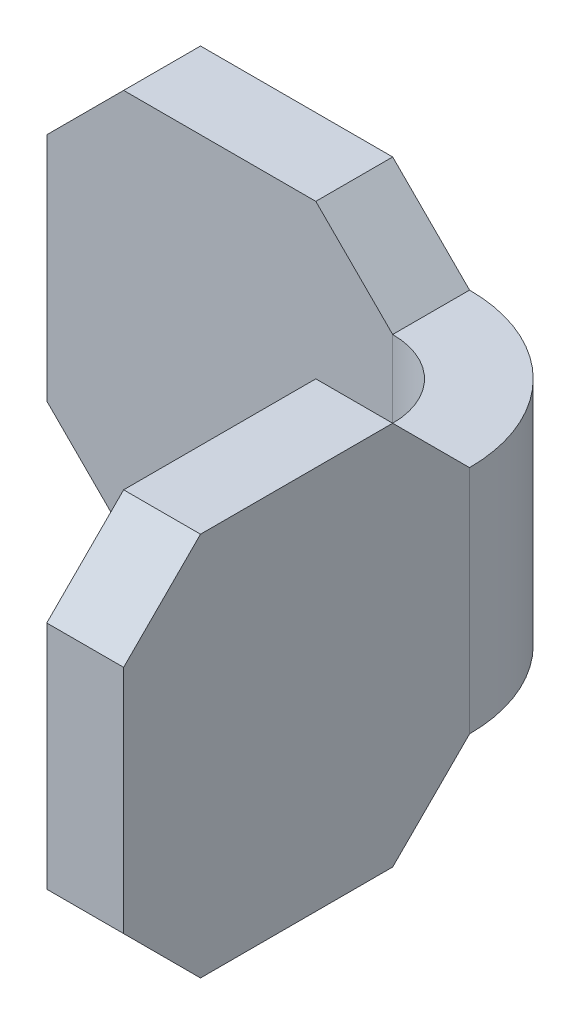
ISO-10303-21;
HEADER;
FILE_DESCRIPTION(('STEP AP214'),'2;1');
FILE_NAME('part.step','',(''),(''),'','','');
FILE_SCHEMA(('AUTOMOTIVE_DESIGN { 1 0 10303 214 1 1 1 1 }'));
ENDSEC;
DATA;
#1=APPLICATION_CONTEXT('core data for automotive mechanical design processes');
#2=APPLICATION_PROTOCOL_DEFINITION('international standard','automotive_design',2000,#1);
#3=PRODUCT_CONTEXT('',#1,'mechanical');
#4=PRODUCT('Part','Part','',(#3));
#5=PRODUCT_RELATED_PRODUCT_CATEGORY('part','',(#4));
#6=PRODUCT_DEFINITION_FORMATION('','',#4);
#7=PRODUCT_DEFINITION_CONTEXT('part definition',#1,'design');
#8=PRODUCT_DEFINITION('design','',#6,#7);
#9=PRODUCT_DEFINITION_SHAPE('','',#8);
#10=(LENGTH_UNIT() NAMED_UNIT(*) SI_UNIT(.MILLI.,.METRE.));
#11=(NAMED_UNIT(*) PLANE_ANGLE_UNIT() SI_UNIT($,.RADIAN.));
#12=(NAMED_UNIT(*) SI_UNIT($,.STERADIAN.) SOLID_ANGLE_UNIT());
#13=UNCERTAINTY_MEASURE_WITH_UNIT(LENGTH_MEASURE(1.E-05),#10,'distance_accuracy_value','');
#14=(GEOMETRIC_REPRESENTATION_CONTEXT(3) GLOBAL_UNCERTAINTY_ASSIGNED_CONTEXT((#13)) GLOBAL_UNIT_ASSIGNED_CONTEXT((#10,
#11,#12)) REPRESENTATION_CONTEXT('',''));
#15=CARTESIAN_POINT('',(0.,0.,0.));
#16=DIRECTION('',(0.,0.,1.));
#17=DIRECTION('',(1.,0.,0.));
#18=AXIS2_PLACEMENT_3D('',#15,#16,#17);
#19=CARTESIAN_POINT('',(1.49999999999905,5.5,0.0499999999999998));
#20=DIRECTION('',(1.,1.720846E-13,0.));
#21=DIRECTION('',(-1.720846E-13,1.,0.));
#22=AXIS2_PLACEMENT_3D('',#19,#20,#21);
#23=PLANE('',#22);
#24=DIRECTION('',(0.,-0.707106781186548,0.707106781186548));
#25=VECTOR('',#24,1.);
#26=CARTESIAN_POINT('',(1.50000000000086,-2.90000000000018,0.400000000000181));
#27=LINE('',#26,#25);
#28=CARTESIAN_POINT('',(1.50000000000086,-5.00000000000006,2.50000000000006));
#29=VERTEX_POINT('',#28);
#30=CARTESIAN_POINT('',(1.50000000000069,-3.,0.500000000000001));
#31=VERTEX_POINT('',#30);
#32=EDGE_CURVE('E57',#29,#31,#27,.F.);
#33=ORIENTED_EDGE('',*,*,#32,.T.);
#34=DIRECTION('',(-1.720846E-13,1.,0.));
#35=VECTOR('',#34,1.);
#36=CARTESIAN_POINT('',(1.49999999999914,5.,0.500000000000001));
#37=LINE('',#36,#35);
#38=CARTESIAN_POINT('',(1.49999999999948,3.,0.500000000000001));
#39=VERTEX_POINT('',#38);
#40=EDGE_CURVE('E206',#39,#31,#37,.F.);
#41=ORIENTED_EDGE('',*,*,#40,.F.);
#42=DIRECTION('',(0.,-0.707106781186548,-0.707106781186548));
#43=VECTOR('',#42,1.);
#44=CARTESIAN_POINT('',(1.49999999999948,5.09999999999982,2.59999999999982));
#45=LINE('',#44,#43);
#46=CARTESIAN_POINT('',(1.49999999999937,5.,2.5));
#47=VERTEX_POINT('',#46);
#48=EDGE_CURVE('E201',#39,#47,#45,.F.);
#49=ORIENTED_EDGE('',*,*,#48,.T.);
#50=DIRECTION('',(0.,0.,1.));
#51=VECTOR('',#50,1.);
#52=CARTESIAN_POINT('',(1.49999999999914,5.,2.25));
#53=LINE('',#52,#51);
#54=CARTESIAN_POINT('',(1.49999999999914,5.,7.5));
#55=VERTEX_POINT('',#54);
#56=EDGE_CURVE('E66',#47,#55,#53,.T.);
#57=ORIENTED_EDGE('',*,*,#56,.T.);
#58=DIRECTION('',(0.,0.707106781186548,-0.707106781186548));
#59=VECTOR('',#58,1.);
#60=CARTESIAN_POINT('',(1.49999999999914,5.10000000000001,7.39999999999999));
#61=LINE('',#60,#59);
#62=CARTESIAN_POINT('',(1.4999999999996,3.,9.5));
#63=VERTEX_POINT('',#62);
#64=EDGE_CURVE('E149',#55,#63,#61,.F.);
#65=ORIENTED_EDGE('',*,*,#64,.T.);
#66=DIRECTION('',(0.,1.,0.));
#67=VECTOR('',#66,1.);
#68=CARTESIAN_POINT('',(1.50000000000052,3.30000000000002,9.5));
#69=LINE('',#68,#67);
#70=CARTESIAN_POINT('',(1.50000000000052,-3.00000000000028,9.49999999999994));
#71=VERTEX_POINT('',#70);
#72=EDGE_CURVE('E179',#71,#63,#69,.T.);
#73=ORIENTED_EDGE('',*,*,#72,.F.);
#74=DIRECTION('',(0.,0.707106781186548,0.707106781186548));
#75=VECTOR('',#74,1.);
#76=CARTESIAN_POINT('',(1.50000000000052,-2.89999999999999,9.60000000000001));
#77=LINE('',#76,#75);
#78=CARTESIAN_POINT('',(1.50000000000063,-5.,7.5));
#79=VERTEX_POINT('',#78);
#80=EDGE_CURVE('E180',#71,#79,#77,.F.);
#81=ORIENTED_EDGE('',*,*,#80,.T.);
#82=DIRECTION('',(0.,0.,1.));
#83=VECTOR('',#82,1.);
#84=CARTESIAN_POINT('',(1.50000000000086,-5.,2.25));
#85=LINE('',#84,#83);
#86=EDGE_CURVE('E189',#29,#79,#85,.T.);
#87=ORIENTED_EDGE('',*,*,#86,.F.);
#88=EDGE_LOOP('',(#33,#41,#49,#57,#65,#73,#81,#87));
#89=FACE_BOUND('',#88,.T.);
#90=ADVANCED_FACE('F16',(#89),#23,.T.);
#91=CARTESIAN_POINT('',(-2.50000000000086,4.99999999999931,0.5));
#92=DIRECTION('',(-1.720846E-13,1.,0.));
#93=DIRECTION('',(-1.,-1.720846E-13,0.));
#94=AXIS2_PLACEMENT_3D('',#91,#92,#93);
#95=CYLINDRICAL_SURFACE('',#94,4.);
#96=ORIENTED_EDGE('',*,*,#40,.T.);
#97=CARTESIAN_POINT('',(-2.49999999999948,-3.00000000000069,0.5));
#98=DIRECTION('',(-1.720846E-13,1.,0.));
#99=DIRECTION('',(-1.,-1.720846E-13,0.));
#100=AXIS2_PLACEMENT_3D('',#97,#98,#99);
#101=CIRCLE('',#100,4.);
#102=CARTESIAN_POINT('',(-2.5,-3.00000000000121,-3.5));
#103=VERTEX_POINT('',#102);
#104=EDGE_CURVE('E19',#31,#103,#101,.T.);
#105=ORIENTED_EDGE('',*,*,#104,.T.);
#106=DIRECTION('',(0.,1.,0.));
#107=VECTOR('',#106,1.);
#108=CARTESIAN_POINT('',(-2.50000000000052,5.49999999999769,-3.5));
#109=LINE('',#108,#107);
#110=CARTESIAN_POINT('',(-2.50000000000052,2.99999999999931,-3.5));
#111=VERTEX_POINT('',#110);
#112=EDGE_CURVE('E203',#111,#103,#109,.F.);
#113=ORIENTED_EDGE('',*,*,#112,.F.);
#114=CARTESIAN_POINT('',(-2.50000000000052,2.99999999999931,0.5));
#115=DIRECTION('',(-1.720846E-13,1.,0.));
#116=DIRECTION('',(-1.,-1.720846E-13,0.));
#117=AXIS2_PLACEMENT_3D('',#114,#115,#116);
#118=CIRCLE('',#117,4.);
#119=EDGE_CURVE('E233',#111,#39,#118,.F.);
#120=ORIENTED_EDGE('',*,*,#119,.T.);
#121=EDGE_LOOP('',(#96,#105,#113,#120));
#122=FACE_BOUND('',#121,.T.);
#123=ADVANCED_FACE('F347',(#122),#95,.T.);
#124=CARTESIAN_POINT('',(-0.599999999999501,-2.90000000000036,0.4));
#125=DIRECTION('',(-1.21638891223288E-13,0.707106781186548,0.707106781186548));
#126=DIRECTION('',(0.,-0.707106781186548,0.707106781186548));
#127=AXIS2_PLACEMENT_3D('',#124,#125,#126);
#128=PLANE('',#127);
#129=DIRECTION('',(-1.,-1.720846E-13,0.));
#130=VECTOR('',#129,1.);
#131=CARTESIAN_POINT('',(1.70000000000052,-2.99999999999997,0.5));
#132=LINE('',#131,#130);
#133=CARTESIAN_POINT('',(-0.499999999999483,-3.00000000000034,0.5));
#134=VERTEX_POINT('',#133);
#135=EDGE_CURVE('E238',#134,#31,#132,.F.);
#136=ORIENTED_EDGE('',*,*,#135,.T.);
#137=ORIENTED_EDGE('',*,*,#32,.F.);
#138=DIRECTION('',(1.,1.720846E-13,0.));
#139=VECTOR('',#138,1.);
#140=CARTESIAN_POINT('',(-0.599999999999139,-5.00000000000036,2.5));
#141=LINE('',#140,#139);
#142=CARTESIAN_POINT('',(-0.499999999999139,-5.00000000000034,2.5));
#143=VERTEX_POINT('',#142);
#144=EDGE_CURVE('E196',#143,#29,#141,.T.);
#145=ORIENTED_EDGE('',*,*,#144,.F.);
#146=DIRECTION('',(1.2174349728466E-13,-0.707106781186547,0.707106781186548));
#147=VECTOR('',#146,1.);
#148=CARTESIAN_POINT('',(-0.499999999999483,-3.00000000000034,0.5));
#149=LINE('',#148,#147);
#150=EDGE_CURVE('E110',#134,#143,#149,.T.);
#151=ORIENTED_EDGE('',*,*,#150,.F.);
#152=EDGE_LOOP('',(#136,#137,#145,#151));
#153=FACE_BOUND('',#152,.T.);
#154=ADVANCED_FACE('F515',(#153),#128,.F.);
#155=CARTESIAN_POINT('',(-0.599999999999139,-5.00000000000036,2.25));
#156=DIRECTION('',(1.720846E-13,-1.,0.));
#157=DIRECTION('',(1.,1.720846E-13,0.));
#158=AXIS2_PLACEMENT_3D('',#155,#156,#157);
#159=PLANE('',#158);
#160=ORIENTED_EDGE('',*,*,#144,.T.);
#161=ORIENTED_EDGE('',*,*,#86,.T.);
#162=DIRECTION('',(1.,0.,0.));
#163=VECTOR('',#162,1.);
#164=CARTESIAN_POINT('',(1.6000000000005,-4.99999999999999,7.49999999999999));
#165=LINE('',#164,#163);
#166=CARTESIAN_POINT('',(-0.499999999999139,-5.00000000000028,7.50000000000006));
#167=VERTEX_POINT('',#166);
#168=EDGE_CURVE('E187',#79,#167,#165,.F.);
#169=ORIENTED_EDGE('',*,*,#168,.T.);
#170=DIRECTION('',(0.,0.,1.));
#171=VECTOR('',#170,1.);
#172=CARTESIAN_POINT('',(-0.499999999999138,-5.00000000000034,9.95));
#173=LINE('',#172,#171);
#174=EDGE_CURVE('E184',#143,#167,#173,.T.);
#175=ORIENTED_EDGE('',*,*,#174,.F.);
#176=EDGE_LOOP('',(#160,#161,#169,#175));
#177=FACE_BOUND('',#176,.T.);
#178=ADVANCED_FACE('F505',(#177),#159,.T.);
#179=CARTESIAN_POINT('',(1.6000000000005,-2.89999999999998,9.6));
#180=DIRECTION('',(-1.21725483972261E-13,0.707106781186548,-0.707106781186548));
#181=DIRECTION('',(0.,0.707106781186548,0.707106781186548));
#182=AXIS2_PLACEMENT_3D('',#179,#180,#181);
#183=PLANE('',#182);
#184=DIRECTION('',(1.,0.,0.));
#185=VECTOR('',#184,1.);
#186=CARTESIAN_POINT('',(1.59999999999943,-3.00000000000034,9.5));
#187=LINE('',#186,#185);
#188=CARTESIAN_POINT('',(-0.499999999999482,-3.00000000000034,9.5));
#189=VERTEX_POINT('',#188);
#190=EDGE_CURVE('E176',#189,#71,#187,.T.);
#191=ORIENTED_EDGE('',*,*,#190,.F.);
#192=DIRECTION('',(-1.21666832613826E-13,0.707106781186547,0.707106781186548));
#193=VECTOR('',#192,1.);
#194=CARTESIAN_POINT('',(-0.499999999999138,-5.00000000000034,7.5));
#195=LINE('',#194,#193);
#196=EDGE_CURVE('E163',#167,#189,#195,.T.);
#197=ORIENTED_EDGE('',*,*,#196,.F.);
#198=ORIENTED_EDGE('',*,*,#168,.F.);
#199=ORIENTED_EDGE('',*,*,#80,.F.);
#200=EDGE_LOOP('',(#191,#197,#198,#199));
#201=FACE_BOUND('',#200,.T.);
#202=ADVANCED_FACE('F495',(#201),#183,.F.);
#203=CARTESIAN_POINT('',(1.59999999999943,3.30000000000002,9.5));
#204=DIRECTION('',(0.,0.,1.));
#205=DIRECTION('',(1.,0.,0.));
#206=AXIS2_PLACEMENT_3D('',#203,#204,#205);
#207=PLANE('',#206);
#208=ORIENTED_EDGE('',*,*,#72,.T.);
#209=DIRECTION('',(1.,0.,0.));
#210=VECTOR('',#209,1.);
#211=CARTESIAN_POINT('',(1.59999999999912,3.00000000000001,9.50000000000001));
#212=LINE('',#211,#210);
#213=CARTESIAN_POINT('',(-0.500000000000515,2.99999999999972,9.49999999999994));
#214=VERTEX_POINT('',#213);
#215=EDGE_CURVE('E170',#63,#214,#212,.F.);
#216=ORIENTED_EDGE('',*,*,#215,.T.);
#217=DIRECTION('',(1.720846E-13,-1.,0.));
#218=VECTOR('',#217,1.);
#219=CARTESIAN_POINT('',(-0.500000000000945,5.49999999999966,9.5));
#220=LINE('',#219,#218);
#221=EDGE_CURVE('E161',#189,#214,#220,.F.);
#222=ORIENTED_EDGE('',*,*,#221,.F.);
#223=ORIENTED_EDGE('',*,*,#190,.T.);
#224=EDGE_LOOP('',(#208,#216,#222,#223));
#225=FACE_BOUND('',#224,.T.);
#226=ADVANCED_FACE('F486',(#225),#207,.T.);
#227=CARTESIAN_POINT('',(1.59999999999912,5.10000000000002,7.4));
#228=DIRECTION('',(1.21638891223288E-13,-0.707106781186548,-0.707106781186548));
#229=DIRECTION('',(0.,0.707106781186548,-0.707106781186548));
#230=AXIS2_PLACEMENT_3D('',#227,#228,#229);
#231=PLANE('',#230);
#232=ORIENTED_EDGE('',*,*,#215,.F.);
#233=ORIENTED_EDGE('',*,*,#64,.F.);
#234=DIRECTION('',(1.,1.720846E-13,0.));
#235=VECTOR('',#234,1.);
#236=CARTESIAN_POINT('',(-0.60000000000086,4.99999999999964,7.5));
#237=LINE('',#236,#235);
#238=CARTESIAN_POINT('',(-0.500000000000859,4.99999999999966,7.5));
#239=VERTEX_POINT('',#238);
#240=EDGE_CURVE('E143',#55,#239,#237,.F.);
#241=ORIENTED_EDGE('',*,*,#240,.T.);
#242=DIRECTION('',(-1.21705164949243E-13,0.707106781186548,-0.707106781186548));
#243=VECTOR('',#242,1.);
#244=CARTESIAN_POINT('',(-0.500000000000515,2.99999999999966,9.5));
#245=LINE('',#244,#243);
#246=EDGE_CURVE('E147',#214,#239,#245,.T.);
#247=ORIENTED_EDGE('',*,*,#246,.F.);
#248=EDGE_LOOP('',(#232,#233,#241,#247));
#249=FACE_BOUND('',#248,.T.);
#250=ADVANCED_FACE('F145',(#249),#231,.F.);
#251=CARTESIAN_POINT('',(-0.60000000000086,4.99999999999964,2.25));
#252=DIRECTION('',(1.720846E-13,-1.,0.));
#253=DIRECTION('',(1.,1.720846E-13,0.));
#254=AXIS2_PLACEMENT_3D('',#251,#252,#253);
#255=PLANE('',#254);
#256=DIRECTION('',(0.,0.,1.));
#257=VECTOR('',#256,1.);
#258=CARTESIAN_POINT('',(-0.500000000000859,4.99999999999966,9.95));
#259=LINE('',#258,#257);
#260=CARTESIAN_POINT('',(-0.500000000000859,4.99999999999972,2.50000000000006));
#261=VERTEX_POINT('',#260);
#262=EDGE_CURVE('E152',#239,#261,#259,.F.);
#263=ORIENTED_EDGE('',*,*,#262,.F.);
#264=ORIENTED_EDGE('',*,*,#240,.F.);
#265=ORIENTED_EDGE('',*,*,#56,.F.);
#266=DIRECTION('',(1.,0.,0.));
#267=VECTOR('',#266,1.);
#268=CARTESIAN_POINT('',(-0.600000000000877,4.99999999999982,2.50000000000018));
#269=LINE('',#268,#267);
#270=EDGE_CURVE('E138',#47,#261,#269,.F.);
#271=ORIENTED_EDGE('',*,*,#270,.T.);
#272=EDGE_LOOP('',(#263,#264,#265,#271));
#273=FACE_BOUND('',#272,.T.);
#274=ADVANCED_FACE('F153',(#273),#255,.F.);
#275=CARTESIAN_POINT('',(-0.600000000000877,5.09999999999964,2.6));
#276=DIRECTION('',(1.21725483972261E-13,-0.707106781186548,0.707106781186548));
#277=DIRECTION('',(0.,-0.707106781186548,-0.707106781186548));
#278=AXIS2_PLACEMENT_3D('',#275,#276,#277);
#279=PLANE('',#278);
#280=DIRECTION('',(1.,1.720846E-13,0.));
#281=VECTOR('',#280,1.);
#282=CARTESIAN_POINT('',(-2.70000000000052,2.99999999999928,0.5));
#283=LINE('',#282,#281);
#284=CARTESIAN_POINT('',(-0.500000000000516,2.99999999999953,0.5));
#285=VERTEX_POINT('',#284);
#286=EDGE_CURVE('E104',#39,#285,#283,.F.);
#287=ORIENTED_EDGE('',*,*,#286,.T.);
#288=DIRECTION('',(1.21628500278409E-13,-0.707106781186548,-0.707106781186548));
#289=VECTOR('',#288,1.);
#290=CARTESIAN_POINT('',(-0.500000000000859,4.99999999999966,2.5));
#291=LINE('',#290,#289);
#292=EDGE_CURVE('E156',#261,#285,#291,.T.);
#293=ORIENTED_EDGE('',*,*,#292,.F.);
#294=ORIENTED_EDGE('',*,*,#270,.F.);
#295=ORIENTED_EDGE('',*,*,#48,.F.);
#296=EDGE_LOOP('',(#287,#293,#294,#295));
#297=FACE_BOUND('',#296,.T.);
#298=ADVANCED_FACE('F346',(#297),#279,.F.);
#299=CARTESIAN_POINT('',(-11.9500000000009,5.49999999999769,-3.5));
#300=DIRECTION('',(0.,0.,-1.));
#301=DIRECTION('',(-1.,0.,0.));
#302=AXIS2_PLACEMENT_3D('',#299,#300,#301);
#303=PLANE('',#302);
#304=DIRECTION('',(1.,1.720846E-13,0.));
#305=VECTOR('',#304,1.);
#306=CARTESIAN_POINT('',(-9.75000000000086,4.99999999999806,-3.5));
#307=LINE('',#306,#305);
#308=CARTESIAN_POINT('',(-9.50000000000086,4.99999999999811,-3.5));
#309=VERTEX_POINT('',#308);
#310=CARTESIAN_POINT('',(-4.50000000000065,4.99999999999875,-3.5));
#311=VERTEX_POINT('',#310);
#312=EDGE_CURVE('E267',#309,#311,#307,.T.);
#313=ORIENTED_EDGE('',*,*,#312,.T.);
#314=DIRECTION('',(0.707106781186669,-0.707106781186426,0.));
#315=VECTOR('',#314,1.);
#316=CARTESIAN_POINT('',(-4.60000000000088,5.09999999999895,-3.5));
#317=LINE('',#316,#315);
#318=EDGE_CURVE('E255',#311,#111,#317,.T.);
#319=ORIENTED_EDGE('',*,*,#318,.T.);
#320=ORIENTED_EDGE('',*,*,#112,.T.);
#321=DIRECTION('',(-0.707106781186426,-0.707106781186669,0.));
#322=VECTOR('',#321,1.);
#323=CARTESIAN_POINT('',(-2.3999999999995,-2.90000000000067,-3.5));
#324=LINE('',#323,#322);
#325=CARTESIAN_POINT('',(-4.49999999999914,-5.00000000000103,-3.5));
#326=VERTEX_POINT('',#325);
#327=EDGE_CURVE('E117',#103,#326,#324,.T.);
#328=ORIENTED_EDGE('',*,*,#327,.T.);
#329=DIRECTION('',(1.,1.720846E-13,0.));
#330=VECTOR('',#329,1.);
#331=CARTESIAN_POINT('',(-9.74999999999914,-5.00000000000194,-3.5));
#332=LINE('',#331,#330);
#333=CARTESIAN_POINT('',(-9.49999999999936,-5.00000000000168,-3.5));
#334=VERTEX_POINT('',#333);
#335=EDGE_CURVE('E250',#334,#326,#332,.T.);
#336=ORIENTED_EDGE('',*,*,#335,.F.);
#337=DIRECTION('',(-0.707106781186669,0.707106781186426,0.));
#338=VECTOR('',#337,1.);
#339=CARTESIAN_POINT('',(-9.39999999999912,-5.10000000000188,-3.5));
#340=LINE('',#339,#338);
#341=CARTESIAN_POINT('',(-11.4999999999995,-3.00000000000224,-3.5));
#342=VERTEX_POINT('',#341);
#343=EDGE_CURVE('E292',#334,#342,#340,.T.);
#344=ORIENTED_EDGE('',*,*,#343,.T.);
#345=DIRECTION('',(1.720846E-13,-1.,0.));
#346=VECTOR('',#345,1.);
#347=CARTESIAN_POINT('',(-11.5000000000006,3.29999999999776,-3.5));
#348=LINE('',#347,#346);
#349=CARTESIAN_POINT('',(-11.5000000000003,2.99999999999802,-3.5));
#350=VERTEX_POINT('',#349);
#351=EDGE_CURVE('E289',#350,#342,#348,.T.);
#352=ORIENTED_EDGE('',*,*,#351,.F.);
#353=DIRECTION('',(0.707106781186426,0.707106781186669,0.));
#354=VECTOR('',#353,1.);
#355=CARTESIAN_POINT('',(-11.6000000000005,2.89999999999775,-3.5));
#356=LINE('',#355,#354);
#357=EDGE_CURVE('E283',#350,#309,#356,.T.);
#358=ORIENTED_EDGE('',*,*,#357,.T.);
#359=EDGE_LOOP('',(#313,#319,#320,#328,#336,#344,#352,#358));
#360=FACE_BOUND('',#359,.T.);
#361=ADVANCED_FACE('F350',(#360),#303,.T.);
#362=CARTESIAN_POINT('',(1.70000000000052,-2.99999999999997,-3.7));
#363=DIRECTION('',(-1.720846E-13,1.,0.));
#364=DIRECTION('',(-1.,-1.720846E-13,0.));
#365=AXIS2_PLACEMENT_3D('',#362,#363,#364);
#366=PLANE('',#365);
#367=ORIENTED_EDGE('',*,*,#135,.F.);
#368=CARTESIAN_POINT('',(-2.49999999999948,-3.00000000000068,0.5));
#369=DIRECTION('',(-1.720846E-13,1.,0.));
#370=DIRECTION('',(-1.,-1.720846E-13,0.));
#371=AXIS2_PLACEMENT_3D('',#368,#369,#370);
#372=CIRCLE('',#371,2.);
#373=CARTESIAN_POINT('',(-2.49999999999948,-3.00000000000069,-1.5));
#374=VERTEX_POINT('',#373);
#375=EDGE_CURVE('E34',#134,#374,#372,.T.);
#376=ORIENTED_EDGE('',*,*,#375,.T.);
#377=DIRECTION('',(0.,0.,1.));
#378=VECTOR('',#377,1.);
#379=CARTESIAN_POINT('',(-2.49999999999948,-3.00000000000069,-3.6));
#380=LINE('',#379,#378);
#381=EDGE_CURVE('E248',#374,#103,#380,.F.);
#382=ORIENTED_EDGE('',*,*,#381,.T.);
#383=ORIENTED_EDGE('',*,*,#104,.F.);
#384=EDGE_LOOP('',(#367,#376,#382,#383));
#385=FACE_BOUND('',#384,.T.);
#386=ADVANCED_FACE('F348',(#385),#366,.F.);
#387=CARTESIAN_POINT('',(-2.70000000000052,2.99999999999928,-3.7));
#388=DIRECTION('',(1.720846E-13,-1.,0.));
#389=DIRECTION('',(1.,1.720846E-13,0.));
#390=AXIS2_PLACEMENT_3D('',#387,#388,#389);
#391=PLANE('',#390);
#392=CARTESIAN_POINT('',(-2.50000000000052,2.99999999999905,0.5));
#393=DIRECTION('',(-1.720846E-13,1.,0.));
#394=DIRECTION('',(-1.,-1.720846E-13,0.));
#395=AXIS2_PLACEMENT_3D('',#392,#393,#394);
#396=CIRCLE('',#395,2.);
#397=CARTESIAN_POINT('',(-2.5,2.99999999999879,-1.5));
#398=VERTEX_POINT('',#397);
#399=EDGE_CURVE('E229',#398,#285,#396,.F.);
#400=ORIENTED_EDGE('',*,*,#399,.T.);
#401=ORIENTED_EDGE('',*,*,#286,.F.);
#402=ORIENTED_EDGE('',*,*,#119,.F.);
#403=DIRECTION('',(0.,0.,1.));
#404=VECTOR('',#403,1.);
#405=CARTESIAN_POINT('',(-2.50000000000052,2.99999999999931,-3.6));
#406=LINE('',#405,#404);
#407=EDGE_CURVE('E259',#111,#398,#406,.T.);
#408=ORIENTED_EDGE('',*,*,#407,.T.);
#409=EDGE_LOOP('',(#400,#401,#402,#408));
#410=FACE_BOUND('',#409,.T.);
#411=ADVANCED_FACE('F345',(#410),#391,.F.);
#412=CARTESIAN_POINT('',(-0.500000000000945,5.49999999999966,9.95));
#413=DIRECTION('',(-1.,-1.720846E-13,0.));
#414=DIRECTION('',(1.720846E-13,-1.,0.));
#415=AXIS2_PLACEMENT_3D('',#412,#413,#414);
#416=PLANE('',#415);
#417=ORIENTED_EDGE('',*,*,#292,.T.);
#418=DIRECTION('',(-1.720846E-13,1.,0.));
#419=VECTOR('',#418,1.);
#420=CARTESIAN_POINT('',(-0.50000000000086,4.99999999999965,0.5));
#421=LINE('',#420,#419);
#422=EDGE_CURVE('E231',#285,#134,#421,.F.);
#423=ORIENTED_EDGE('',*,*,#422,.T.);
#424=ORIENTED_EDGE('',*,*,#150,.T.);
#425=ORIENTED_EDGE('',*,*,#174,.T.);
#426=ORIENTED_EDGE('',*,*,#196,.T.);
#427=ORIENTED_EDGE('',*,*,#221,.T.);
#428=ORIENTED_EDGE('',*,*,#246,.T.);
#429=ORIENTED_EDGE('',*,*,#262,.T.);
#430=EDGE_LOOP('',(#417,#423,#424,#425,#426,#427,#428,#429));
#431=FACE_BOUND('',#430,.T.);
#432=ADVANCED_FACE('F158',(#431),#416,.T.);
#433=CARTESIAN_POINT('',(-4.60000000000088,5.09999999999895,-3.6));
#434=DIRECTION('',(-0.707106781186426,-0.707106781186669,0.));
#435=DIRECTION('',(0.707106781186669,-0.707106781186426,0.));
#436=AXIS2_PLACEMENT_3D('',#433,#434,#435);
#437=PLANE('',#436);
#438=DIRECTION('',(0.,0.,1.));
#439=VECTOR('',#438,1.);
#440=CARTESIAN_POINT('',(-4.50000000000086,4.99999999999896,-3.6));
#441=LINE('',#440,#439);
#442=CARTESIAN_POINT('',(-4.50000000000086,4.99999999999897,-1.5));
#443=VERTEX_POINT('',#442);
#444=EDGE_CURVE('E258',#311,#443,#441,.T.);
#445=ORIENTED_EDGE('',*,*,#444,.T.);
#446=DIRECTION('',(-0.707106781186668,0.707106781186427,0.));
#447=VECTOR('',#446,1.);
#448=CARTESIAN_POINT('',(-2.50000000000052,2.99999999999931,-1.5));
#449=LINE('',#448,#447);
#450=EDGE_CURVE('E274',#398,#443,#449,.T.);
#451=ORIENTED_EDGE('',*,*,#450,.F.);
#452=ORIENTED_EDGE('',*,*,#407,.F.);
#453=ORIENTED_EDGE('',*,*,#318,.F.);
#454=EDGE_LOOP('',(#445,#451,#452,#453));
#455=FACE_BOUND('',#454,.T.);
#456=ADVANCED_FACE('F337',(#455),#437,.F.);
#457=CARTESIAN_POINT('',(-9.75000000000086,4.99999999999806,-3.6));
#458=DIRECTION('',(1.720846E-13,-1.,0.));
#459=DIRECTION('',(1.,1.720846E-13,0.));
#460=AXIS2_PLACEMENT_3D('',#457,#458,#459);
#461=PLANE('',#460);
#462=DIRECTION('',(0.,0.,1.));
#463=VECTOR('',#462,1.);
#464=CARTESIAN_POINT('',(-9.50000000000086,4.99999999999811,-3.6));
#465=LINE('',#464,#463);
#466=CARTESIAN_POINT('',(-9.50000000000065,4.99999999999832,-1.5));
#467=VERTEX_POINT('',#466);
#468=EDGE_CURVE('E280',#309,#467,#465,.T.);
#469=ORIENTED_EDGE('',*,*,#468,.T.);
#470=DIRECTION('',(1.,0.,0.));
#471=VECTOR('',#470,1.);
#472=CARTESIAN_POINT('',(-2.05000000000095,4.99999999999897,-1.5));
#473=LINE('',#472,#471);
#474=EDGE_CURVE('E277',#443,#467,#473,.F.);
#475=ORIENTED_EDGE('',*,*,#474,.F.);
#476=ORIENTED_EDGE('',*,*,#444,.F.);
#477=ORIENTED_EDGE('',*,*,#312,.F.);
#478=EDGE_LOOP('',(#469,#475,#476,#477));
#479=FACE_BOUND('',#478,.T.);
#480=ADVANCED_FACE('F339',(#479),#461,.F.);
#481=CARTESIAN_POINT('',(-11.6000000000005,2.89999999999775,-3.6));
#482=DIRECTION('',(0.707106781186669,-0.707106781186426,0.));
#483=DIRECTION('',(0.707106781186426,0.707106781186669,0.));
#484=AXIS2_PLACEMENT_3D('',#481,#482,#483);
#485=PLANE('',#484);
#486=DIRECTION('',(0.,0.,1.));
#487=VECTOR('',#486,1.);
#488=CARTESIAN_POINT('',(-11.5000000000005,2.99999999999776,-1.4));
#489=LINE('',#488,#487);
#490=CARTESIAN_POINT('',(-11.5000000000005,2.99999999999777,-1.5));
#491=VERTEX_POINT('',#490);
#492=EDGE_CURVE('E286',#491,#350,#489,.F.);
#493=ORIENTED_EDGE('',*,*,#492,.F.);
#494=DIRECTION('',(-0.707106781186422,-0.707106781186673,0.));
#495=VECTOR('',#494,1.);
#496=CARTESIAN_POINT('',(-9.50000000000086,4.99999999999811,-1.5));
#497=LINE('',#496,#495);
#498=EDGE_CURVE('E304',#467,#491,#497,.T.);
#499=ORIENTED_EDGE('',*,*,#498,.F.);
#500=ORIENTED_EDGE('',*,*,#468,.F.);
#501=ORIENTED_EDGE('',*,*,#357,.F.);
#502=EDGE_LOOP('',(#493,#499,#500,#501));
#503=FACE_BOUND('',#502,.T.);
#504=ADVANCED_FACE('F403',(#503),#485,.F.);
#505=CARTESIAN_POINT('',(-11.5000000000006,3.29999999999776,-1.4));
#506=DIRECTION('',(-1.,-1.720846E-13,0.));
#507=DIRECTION('',(1.720846E-13,-1.,0.));
#508=AXIS2_PLACEMENT_3D('',#505,#506,#507);
#509=PLANE('',#508);
#510=ORIENTED_EDGE('',*,*,#351,.T.);
#511=DIRECTION('',(0.,0.,1.));
#512=VECTOR('',#511,1.);
#513=CARTESIAN_POINT('',(-11.4999999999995,-3.00000000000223,-3.6));
#514=LINE('',#513,#512);
#515=CARTESIAN_POINT('',(-11.4999999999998,-3.00000000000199,-1.5));
#516=VERTEX_POINT('',#515);
#517=EDGE_CURVE('E294',#342,#516,#514,.T.);
#518=ORIENTED_EDGE('',*,*,#517,.T.);
#519=DIRECTION('',(0.,1.,0.));
#520=VECTOR('',#519,1.);
#521=CARTESIAN_POINT('',(-11.5000000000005,5.49999999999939,-1.5));
#522=LINE('',#521,#520);
#523=EDGE_CURVE('E307',#491,#516,#522,.F.);
#524=ORIENTED_EDGE('',*,*,#523,.F.);
#525=ORIENTED_EDGE('',*,*,#492,.T.);
#526=EDGE_LOOP('',(#510,#518,#524,#525));
#527=FACE_BOUND('',#526,.T.);
#528=ADVANCED_FACE('F394',(#527),#509,.T.);
#529=CARTESIAN_POINT('',(-9.39999999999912,-5.10000000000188,-3.6));
#530=DIRECTION('',(0.707106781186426,0.707106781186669,0.));
#531=DIRECTION('',(-0.707106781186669,0.707106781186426,0.));
#532=AXIS2_PLACEMENT_3D('',#529,#530,#531);
#533=PLANE('',#532);
#534=ORIENTED_EDGE('',*,*,#517,.F.);
#535=ORIENTED_EDGE('',*,*,#343,.F.);
#536=DIRECTION('',(0.,0.,1.));
#537=VECTOR('',#536,1.);
#538=CARTESIAN_POINT('',(-9.49999999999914,-5.0000000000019,-3.6));
#539=LINE('',#538,#537);
#540=CARTESIAN_POINT('',(-9.49999999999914,-5.00000000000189,-1.5));
#541=VERTEX_POINT('',#540);
#542=EDGE_CURVE('E297',#541,#334,#539,.F.);
#543=ORIENTED_EDGE('',*,*,#542,.F.);
#544=DIRECTION('',(0.707106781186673,-0.707106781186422,0.));
#545=VECTOR('',#544,1.);
#546=CARTESIAN_POINT('',(-11.4999999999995,-3.00000000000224,-1.5));
#547=LINE('',#546,#545);
#548=EDGE_CURVE('E310',#516,#541,#547,.T.);
#549=ORIENTED_EDGE('',*,*,#548,.F.);
#550=EDGE_LOOP('',(#534,#535,#543,#549));
#551=FACE_BOUND('',#550,.T.);
#552=ADVANCED_FACE('F360',(#551),#533,.F.);
#553=CARTESIAN_POINT('',(-9.74999999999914,-5.00000000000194,-3.6));
#554=DIRECTION('',(1.720846E-13,-1.,0.));
#555=DIRECTION('',(1.,1.720846E-13,0.));
#556=AXIS2_PLACEMENT_3D('',#553,#554,#555);
#557=PLANE('',#556);
#558=ORIENTED_EDGE('',*,*,#335,.T.);
#559=DIRECTION('',(0.,0.,1.));
#560=VECTOR('',#559,1.);
#561=CARTESIAN_POINT('',(-4.49999999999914,-5.00000000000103,-3.6));
#562=LINE('',#561,#560);
#563=CARTESIAN_POINT('',(-4.49999999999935,-5.00000000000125,-1.5));
#564=VERTEX_POINT('',#563);
#565=EDGE_CURVE('E232',#326,#564,#562,.T.);
#566=ORIENTED_EDGE('',*,*,#565,.T.);
#567=DIRECTION('',(1.,0.,0.));
#568=VECTOR('',#567,1.);
#569=CARTESIAN_POINT('',(-2.05000000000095,-5.00000000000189,-1.5));
#570=LINE('',#569,#568);
#571=EDGE_CURVE('E252',#541,#564,#570,.T.);
#572=ORIENTED_EDGE('',*,*,#571,.F.);
#573=ORIENTED_EDGE('',*,*,#542,.T.);
#574=EDGE_LOOP('',(#558,#566,#572,#573));
#575=FACE_BOUND('',#574,.T.);
#576=ADVANCED_FACE('F320',(#575),#557,.T.);
#577=CARTESIAN_POINT('',(-2.3999999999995,-2.90000000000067,-3.6));
#578=DIRECTION('',(-0.707106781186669,0.707106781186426,0.));
#579=DIRECTION('',(-0.707106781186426,-0.707106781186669,0.));
#580=AXIS2_PLACEMENT_3D('',#577,#578,#579);
#581=PLANE('',#580);
#582=ORIENTED_EDGE('',*,*,#565,.F.);
#583=ORIENTED_EDGE('',*,*,#327,.F.);
#584=ORIENTED_EDGE('',*,*,#381,.F.);
#585=DIRECTION('',(0.707106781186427,0.707106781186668,0.));
#586=VECTOR('',#585,1.);
#587=CARTESIAN_POINT('',(-4.49999999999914,-5.00000000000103,-1.5));
#588=LINE('',#587,#586);
#589=EDGE_CURVE('E25',#564,#374,#588,.T.);
#590=ORIENTED_EDGE('',*,*,#589,.F.);
#591=EDGE_LOOP('',(#582,#583,#584,#590));
#592=FACE_BOUND('',#591,.T.);
#593=ADVANCED_FACE('F351',(#592),#581,.F.);
#594=CARTESIAN_POINT('',(-2.50000000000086,4.99999999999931,0.5));
#595=DIRECTION('',(-1.720846E-13,1.,0.));
#596=DIRECTION('',(-1.,-1.720846E-13,0.));
#597=AXIS2_PLACEMENT_3D('',#594,#595,#596);
#598=CYLINDRICAL_SURFACE('',#597,2.);
#599=ORIENTED_EDGE('',*,*,#399,.F.);
#600=DIRECTION('',(0.,1.,0.));
#601=VECTOR('',#600,1.);
#602=CARTESIAN_POINT('',(-2.49999999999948,5.49999999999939,-1.5));
#603=LINE('',#602,#601);
#604=EDGE_CURVE('E10',#374,#398,#603,.T.);
#605=ORIENTED_EDGE('',*,*,#604,.F.);
#606=ORIENTED_EDGE('',*,*,#375,.F.);
#607=ORIENTED_EDGE('',*,*,#422,.F.);
#608=EDGE_LOOP('',(#599,#605,#606,#607));
#609=FACE_BOUND('',#608,.T.);
#610=ADVANCED_FACE('F342',(#609),#598,.F.);
#611=CARTESIAN_POINT('',(-2.05000000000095,5.49999999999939,-1.5));
#612=DIRECTION('',(0.,0.,1.));
#613=DIRECTION('',(1.,0.,0.));
#614=AXIS2_PLACEMENT_3D('',#611,#612,#613);
#615=PLANE('',#614);
#616=ORIENTED_EDGE('',*,*,#589,.T.);
#617=ORIENTED_EDGE('',*,*,#604,.T.);
#618=ORIENTED_EDGE('',*,*,#450,.T.);
#619=ORIENTED_EDGE('',*,*,#474,.T.);
#620=ORIENTED_EDGE('',*,*,#498,.T.);
#621=ORIENTED_EDGE('',*,*,#523,.T.);
#622=ORIENTED_EDGE('',*,*,#548,.T.);
#623=ORIENTED_EDGE('',*,*,#571,.T.);
#624=EDGE_LOOP('',(#616,#617,#618,#619,#620,#621,#622,#623));
#625=FACE_BOUND('',#624,.T.);
#626=ADVANCED_FACE('F316',(#625),#615,.T.);
#627=CLOSED_SHELL('',(#90,#123,#154,#178,#202,#226,#250,#274,#298,#361,#386,#411,#432,#456,#480,
#504,#528,#552,#576,#593,#610,#626));
#628=MANIFOLD_SOLID_BREP('B1',#627);
#629=ADVANCED_BREP_SHAPE_REPRESENTATION('',(#18,#628),#14);
#630=SHAPE_DEFINITION_REPRESENTATION(#9,#629);
ENDSEC;
END-ISO-10303-21;
